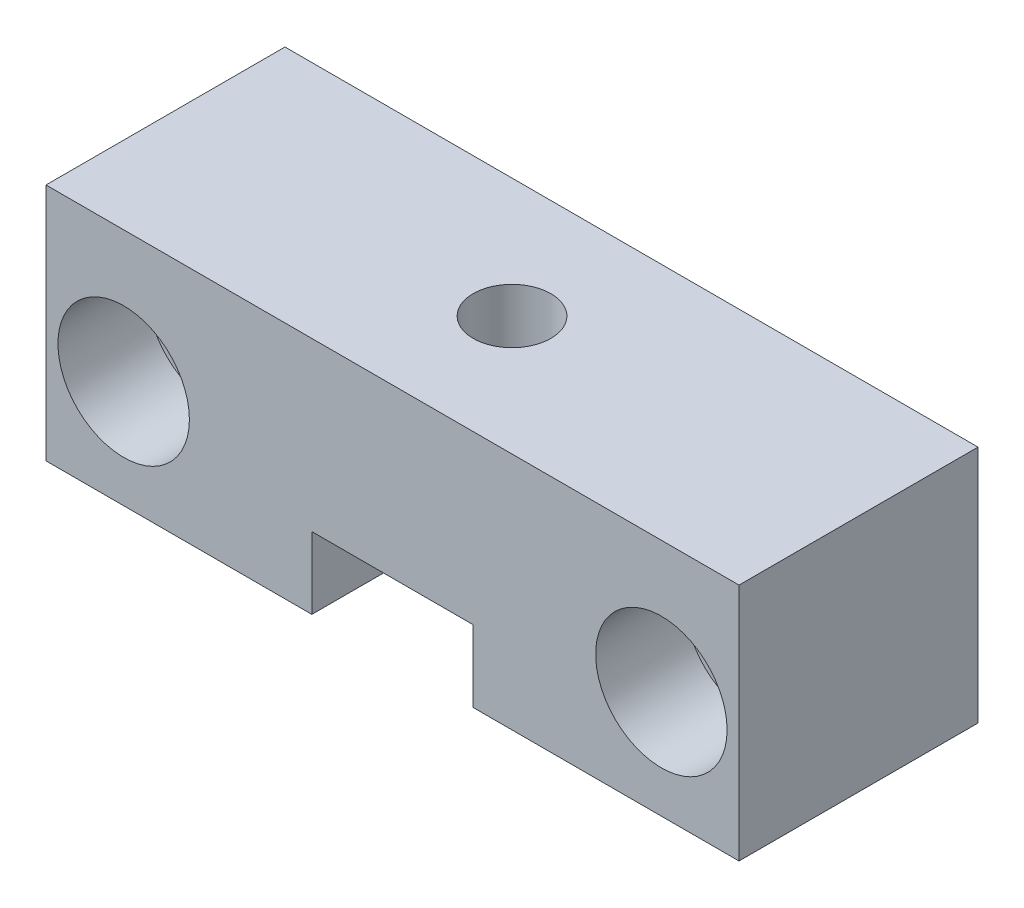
ISO-10303-21;
HEADER;
FILE_DESCRIPTION(('STEP AP214'),'2;1');
FILE_NAME('part.step','',(''),(''),'','','');
FILE_SCHEMA(('AUTOMOTIVE_DESIGN { 1 0 10303 214 1 1 1 1 }'));
ENDSEC;
DATA;
#1=APPLICATION_CONTEXT('core data for automotive mechanical design processes');
#2=APPLICATION_PROTOCOL_DEFINITION('international standard','automotive_design',2000,#1);
#3=PRODUCT_CONTEXT('',#1,'mechanical');
#4=PRODUCT('Part','Part','',(#3));
#5=PRODUCT_RELATED_PRODUCT_CATEGORY('part','',(#4));
#6=PRODUCT_DEFINITION_FORMATION('','',#4);
#7=PRODUCT_DEFINITION_CONTEXT('part definition',#1,'design');
#8=PRODUCT_DEFINITION('design','',#6,#7);
#9=PRODUCT_DEFINITION_SHAPE('','',#8);
#10=(LENGTH_UNIT() NAMED_UNIT(*) SI_UNIT(.MILLI.,.METRE.));
#11=(NAMED_UNIT(*) PLANE_ANGLE_UNIT() SI_UNIT($,.RADIAN.));
#12=(NAMED_UNIT(*) SI_UNIT($,.STERADIAN.) SOLID_ANGLE_UNIT());
#13=UNCERTAINTY_MEASURE_WITH_UNIT(LENGTH_MEASURE(1.E-05),#10,'distance_accuracy_value','');
#14=(GEOMETRIC_REPRESENTATION_CONTEXT(3) GLOBAL_UNCERTAINTY_ASSIGNED_CONTEXT((#13)) GLOBAL_UNIT_ASSIGNED_CONTEXT((#10,
#11,#12)) REPRESENTATION_CONTEXT('',''));
#15=CARTESIAN_POINT('',(0.,0.,0.));
#16=DIRECTION('',(0.,0.,1.));
#17=DIRECTION('',(1.,0.,0.));
#18=AXIS2_PLACEMENT_3D('',#15,#16,#17);
#19=CARTESIAN_POINT('',(22.5,0.,-7.5));
#20=DIRECTION('',(0.,0.,1.));
#21=DIRECTION('',(1.,0.,0.));
#22=AXIS2_PLACEMENT_3D('',#19,#20,#21);
#23=PLANE('',#22);
#24=CARTESIAN_POINT('',(22.5,0.,-7.5));
#25=DIRECTION('',(0.,0.,1.));
#26=DIRECTION('',(1.,0.,0.));
#27=AXIS2_PLACEMENT_3D('',#24,#25,#26);
#28=CIRCLE('',#27,3.);
#29=CARTESIAN_POINT('',(25.5,0.,-7.5));
#30=VERTEX_POINT('',#29);
#31=EDGE_CURVE('E18',#30,#30,#28,.F.);
#32=ORIENTED_EDGE('',*,*,#31,.T.);
#33=EDGE_LOOP('',(#32));
#34=FACE_BOUND('',#33,.T.);
#35=CARTESIAN_POINT('',(22.5,0.,-7.5));
#36=DIRECTION('',(0.,0.,1.));
#37=DIRECTION('',(1.,0.,0.));
#38=AXIS2_PLACEMENT_3D('',#35,#36,#37);
#39=CIRCLE('',#38,5.5);
#40=CARTESIAN_POINT('',(28.,0.,-7.5));
#41=VERTEX_POINT('',#40);
#42=EDGE_CURVE('E118',#41,#41,#39,.T.);
#43=ORIENTED_EDGE('',*,*,#42,.T.);
#44=EDGE_LOOP('',(#43));
#45=FACE_BOUND('',#44,.T.);
#46=ADVANCED_FACE('F15',(#34,#45),#23,.T.);
#47=CARTESIAN_POINT('',(-22.5,0.,-7.5));
#48=DIRECTION('',(0.,0.,1.));
#49=DIRECTION('',(1.,0.,0.));
#50=AXIS2_PLACEMENT_3D('',#47,#48,#49);
#51=PLANE('',#50);
#52=CARTESIAN_POINT('',(-22.5,0.,-7.5));
#53=DIRECTION('',(0.,0.,1.));
#54=DIRECTION('',(1.,0.,0.));
#55=AXIS2_PLACEMENT_3D('',#52,#53,#54);
#56=CIRCLE('',#55,3.);
#57=CARTESIAN_POINT('',(-19.5,0.,-7.5));
#58=VERTEX_POINT('',#57);
#59=EDGE_CURVE('E147',#58,#58,#56,.F.);
#60=ORIENTED_EDGE('',*,*,#59,.T.);
#61=EDGE_LOOP('',(#60));
#62=FACE_BOUND('',#61,.T.);
#63=CARTESIAN_POINT('',(-22.5,0.,-7.5));
#64=DIRECTION('',(0.,0.,1.));
#65=DIRECTION('',(1.,0.,0.));
#66=AXIS2_PLACEMENT_3D('',#63,#64,#65);
#67=CIRCLE('',#66,5.5);
#68=CARTESIAN_POINT('',(-17.,0.,-7.5));
#69=VERTEX_POINT('',#68);
#70=EDGE_CURVE('E93',#69,#69,#67,.T.);
#71=ORIENTED_EDGE('',*,*,#70,.T.);
#72=EDGE_LOOP('',(#71));
#73=FACE_BOUND('',#72,.T.);
#74=ADVANCED_FACE('F263',(#62,#73),#51,.T.);
#75=CARTESIAN_POINT('',(0.,-1.00000000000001,-10.));
#76=DIRECTION('',(0.,-1.,0.));
#77=DIRECTION('',(1.,0.,0.));
#78=AXIS2_PLACEMENT_3D('',#75,#76,#77);
#79=CYLINDRICAL_SURFACE('',#78,4.25);
#80=CARTESIAN_POINT('',(0.,0.99999999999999,-10.));
#81=DIRECTION('',(0.,-1.,0.));
#82=DIRECTION('',(1.,0.,0.));
#83=AXIS2_PLACEMENT_3D('',#80,#81,#82);
#84=CIRCLE('',#83,4.25);
#85=CARTESIAN_POINT('',(4.25,0.99999999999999,-10.));
#86=VERTEX_POINT('',#85);
#87=EDGE_CURVE('E92',#86,#86,#84,.T.);
#88=ORIENTED_EDGE('',*,*,#87,.F.);
#89=EDGE_LOOP('',(#88));
#90=FACE_BOUND('',#89,.T.);
#91=CARTESIAN_POINT('',(0.,-3.00000000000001,-10.));
#92=DIRECTION('',(0.,-1.,0.));
#93=DIRECTION('',(1.,0.,0.));
#94=AXIS2_PLACEMENT_3D('',#91,#92,#93);
#95=CIRCLE('',#94,4.25);
#96=CARTESIAN_POINT('',(4.25,-3.00000000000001,-10.));
#97=VERTEX_POINT('',#96);
#98=EDGE_CURVE('E122',#97,#97,#95,.F.);
#99=ORIENTED_EDGE('',*,*,#98,.F.);
#100=EDGE_LOOP('',(#99));
#101=FACE_BOUND('',#100,.T.);
#102=ADVANCED_FACE('F160',(#90,#101),#79,.F.);
#103=CARTESIAN_POINT('',(22.5,0.,-64.5290632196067));
#104=DIRECTION('',(0.,0.,1.));
#105=DIRECTION('',(1.,0.,0.));
#106=AXIS2_PLACEMENT_3D('',#103,#104,#105);
#107=CYLINDRICAL_SURFACE('',#106,3.);
#108=ORIENTED_EDGE('',*,*,#31,.F.);
#109=EDGE_LOOP('',(#108));
#110=FACE_BOUND('',#109,.T.);
#111=CARTESIAN_POINT('',(22.5,0.,-20.));
#112=DIRECTION('',(0.,0.,1.));
#113=DIRECTION('',(1.,0.,0.));
#114=AXIS2_PLACEMENT_3D('',#111,#112,#113);
#115=CIRCLE('',#114,3.);
#116=CARTESIAN_POINT('',(25.5,0.,-20.));
#117=VERTEX_POINT('',#116);
#118=EDGE_CURVE('E102',#117,#117,#115,.F.);
#119=ORIENTED_EDGE('',*,*,#118,.T.);
#120=EDGE_LOOP('',(#119));
#121=FACE_BOUND('',#120,.T.);
#122=ADVANCED_FACE('F156',(#110,#121),#107,.F.);
#123=CARTESIAN_POINT('',(-22.5,0.,-64.5290632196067));
#124=DIRECTION('',(0.,0.,1.));
#125=DIRECTION('',(1.,0.,0.));
#126=AXIS2_PLACEMENT_3D('',#123,#124,#125);
#127=CYLINDRICAL_SURFACE('',#126,3.);
#128=ORIENTED_EDGE('',*,*,#59,.F.);
#129=EDGE_LOOP('',(#128));
#130=FACE_BOUND('',#129,.T.);
#131=CARTESIAN_POINT('',(-22.5,0.,-20.));
#132=DIRECTION('',(0.,0.,1.));
#133=DIRECTION('',(1.,0.,0.));
#134=AXIS2_PLACEMENT_3D('',#131,#132,#133);
#135=CIRCLE('',#134,3.);
#136=CARTESIAN_POINT('',(-19.5,0.,-20.));
#137=VERTEX_POINT('',#136);
#138=EDGE_CURVE('E136',#137,#137,#135,.F.);
#139=ORIENTED_EDGE('',*,*,#138,.T.);
#140=EDGE_LOOP('',(#139));
#141=FACE_BOUND('',#140,.T.);
#142=ADVANCED_FACE('F159',(#130,#141),#127,.F.);
#143=CARTESIAN_POINT('',(-6.75,-3.00000000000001,0.));
#144=DIRECTION('',(0.,-1.,0.));
#145=DIRECTION('',(0.,0.,-1.));
#146=AXIS2_PLACEMENT_3D('',#143,#144,#145);
#147=PLANE('',#146);
#148=ORIENTED_EDGE('',*,*,#98,.T.);
#149=EDGE_LOOP('',(#148));
#150=FACE_BOUND('',#149,.T.);
#151=DIRECTION('',(1.,0.,0.));
#152=VECTOR('',#151,1.);
#153=CARTESIAN_POINT('',(0.,-3.00000000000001,0.));
#154=LINE('',#153,#152);
#155=CARTESIAN_POINT('',(-6.75,-3.00000000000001,0.));
#156=VERTEX_POINT('',#155);
#157=CARTESIAN_POINT('',(6.75,-3.00000000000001,0.));
#158=VERTEX_POINT('',#157);
#159=EDGE_CURVE('E219',#156,#158,#154,.T.);
#160=ORIENTED_EDGE('',*,*,#159,.F.);
#161=DIRECTION('',(0.,0.,-1.));
#162=VECTOR('',#161,1.);
#163=CARTESIAN_POINT('',(-6.75,-3.00000000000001,0.));
#164=LINE('',#163,#162);
#165=CARTESIAN_POINT('',(-6.75,-3.00000000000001,-20.));
#166=VERTEX_POINT('',#165);
#167=EDGE_CURVE('E119',#166,#156,#164,.F.);
#168=ORIENTED_EDGE('',*,*,#167,.F.);
#169=DIRECTION('',(1.,0.,0.));
#170=VECTOR('',#169,1.);
#171=CARTESIAN_POINT('',(0.,-3.00000000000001,-20.));
#172=LINE('',#171,#170);
#173=CARTESIAN_POINT('',(6.75,-3.00000000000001,-20.));
#174=VERTEX_POINT('',#173);
#175=EDGE_CURVE('E103',#166,#174,#172,.T.);
#176=ORIENTED_EDGE('',*,*,#175,.T.);
#177=DIRECTION('',(0.,0.,1.));
#178=VECTOR('',#177,1.);
#179=CARTESIAN_POINT('',(6.75,-3.00000000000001,0.));
#180=LINE('',#179,#178);
#181=EDGE_CURVE('E99',#158,#174,#180,.F.);
#182=ORIENTED_EDGE('',*,*,#181,.F.);
#183=EDGE_LOOP('',(#160,#168,#176,#182));
#184=FACE_BOUND('',#183,.T.);
#185=ADVANCED_FACE('F230',(#150,#184),#147,.T.);
#186=CARTESIAN_POINT('',(6.75,-3.00000000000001,0.));
#187=DIRECTION('',(-1.,0.,0.));
#188=DIRECTION('',(0.,0.,1.));
#189=AXIS2_PLACEMENT_3D('',#186,#187,#188);
#190=PLANE('',#189);
#191=DIRECTION('',(0.,1.,0.));
#192=VECTOR('',#191,1.);
#193=CARTESIAN_POINT('',(6.75,0.982142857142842,0.));
#194=LINE('',#193,#192);
#195=CARTESIAN_POINT('',(6.75,-9.00000000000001,0.));
#196=VERTEX_POINT('',#195);
#197=EDGE_CURVE('E217',#158,#196,#194,.F.);
#198=ORIENTED_EDGE('',*,*,#197,.F.);
#199=ORIENTED_EDGE('',*,*,#181,.T.);
#200=DIRECTION('',(0.,1.,0.));
#201=VECTOR('',#200,1.);
#202=CARTESIAN_POINT('',(6.75,0.982142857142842,-20.));
#203=LINE('',#202,#201);
#204=CARTESIAN_POINT('',(6.75,-9.00000000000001,-20.));
#205=VERTEX_POINT('',#204);
#206=EDGE_CURVE('E97',#174,#205,#203,.F.);
#207=ORIENTED_EDGE('',*,*,#206,.T.);
#208=DIRECTION('',(0.,0.,-1.));
#209=VECTOR('',#208,1.);
#210=CARTESIAN_POINT('',(6.75,-9.00000000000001,0.));
#211=LINE('',#210,#209);
#212=EDGE_CURVE('E81',#196,#205,#211,.T.);
#213=ORIENTED_EDGE('',*,*,#212,.F.);
#214=EDGE_LOOP('',(#198,#199,#207,#213));
#215=FACE_BOUND('',#214,.T.);
#216=ADVANCED_FACE('F98',(#215),#190,.T.);
#217=CARTESIAN_POINT('',(-29.,-9.00000000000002,0.));
#218=DIRECTION('',(0.,-1.,0.));
#219=DIRECTION('',(0.,0.,-1.));
#220=AXIS2_PLACEMENT_3D('',#217,#218,#219);
#221=PLANE('',#220);
#222=DIRECTION('',(1.,0.,0.));
#223=VECTOR('',#222,1.);
#224=CARTESIAN_POINT('',(0.,-9.00000000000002,0.));
#225=LINE('',#224,#223);
#226=CARTESIAN_POINT('',(-29.,-9.00000000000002,0.));
#227=VERTEX_POINT('',#226);
#228=CARTESIAN_POINT('',(-6.75,-9.00000000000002,0.));
#229=VERTEX_POINT('',#228);
#230=EDGE_CURVE('E207',#227,#229,#225,.T.);
#231=ORIENTED_EDGE('',*,*,#230,.F.);
#232=DIRECTION('',(0.,0.,1.));
#233=VECTOR('',#232,1.);
#234=CARTESIAN_POINT('',(-29.,-9.00000000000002,0.));
#235=LINE('',#234,#233);
#236=CARTESIAN_POINT('',(-29.,-9.00000000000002,-20.));
#237=VERTEX_POINT('',#236);
#238=EDGE_CURVE('E221',#237,#227,#235,.T.);
#239=ORIENTED_EDGE('',*,*,#238,.F.);
#240=DIRECTION('',(1.,0.,0.));
#241=VECTOR('',#240,1.);
#242=CARTESIAN_POINT('',(0.,-9.00000000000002,-20.));
#243=LINE('',#242,#241);
#244=CARTESIAN_POINT('',(-6.75,-9.00000000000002,-20.));
#245=VERTEX_POINT('',#244);
#246=EDGE_CURVE('E76',#237,#245,#243,.T.);
#247=ORIENTED_EDGE('',*,*,#246,.T.);
#248=DIRECTION('',(0.,0.,-1.));
#249=VECTOR('',#248,1.);
#250=CARTESIAN_POINT('',(-6.75,-9.00000000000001,0.));
#251=LINE('',#250,#249);
#252=EDGE_CURVE('E116',#229,#245,#251,.T.);
#253=ORIENTED_EDGE('',*,*,#252,.F.);
#254=EDGE_LOOP('',(#231,#239,#247,#253));
#255=FACE_BOUND('',#254,.T.);
#256=ADVANCED_FACE('F244',(#255),#221,.T.);
#257=CARTESIAN_POINT('',(-6.75,-9.00000000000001,0.));
#258=DIRECTION('',(1.,0.,0.));
#259=DIRECTION('',(0.,0.,-1.));
#260=AXIS2_PLACEMENT_3D('',#257,#258,#259);
#261=PLANE('',#260);
#262=DIRECTION('',(0.,1.,0.));
#263=VECTOR('',#262,1.);
#264=CARTESIAN_POINT('',(-6.75,0.982142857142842,0.));
#265=LINE('',#264,#263);
#266=EDGE_CURVE('E135',#229,#156,#265,.T.);
#267=ORIENTED_EDGE('',*,*,#266,.F.);
#268=ORIENTED_EDGE('',*,*,#252,.T.);
#269=DIRECTION('',(0.,1.,0.));
#270=VECTOR('',#269,1.);
#271=CARTESIAN_POINT('',(-6.75,0.982142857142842,-20.));
#272=LINE('',#271,#270);
#273=EDGE_CURVE('E110',#245,#166,#272,.T.);
#274=ORIENTED_EDGE('',*,*,#273,.T.);
#275=ORIENTED_EDGE('',*,*,#167,.T.);
#276=EDGE_LOOP('',(#267,#268,#274,#275));
#277=FACE_BOUND('',#276,.T.);
#278=ADVANCED_FACE('F228',(#277),#261,.T.);
#279=CARTESIAN_POINT('',(22.5,0.,-3.75));
#280=DIRECTION('',(0.,0.,1.));
#281=DIRECTION('',(1.,0.,0.));
#282=AXIS2_PLACEMENT_3D('',#279,#280,#281);
#283=CYLINDRICAL_SURFACE('',#282,5.5);
#284=ORIENTED_EDGE('',*,*,#42,.F.);
#285=EDGE_LOOP('',(#284));
#286=FACE_BOUND('',#285,.T.);
#287=CARTESIAN_POINT('',(22.5,0.,0.));
#288=DIRECTION('',(0.,0.,1.));
#289=DIRECTION('',(1.,0.,0.));
#290=AXIS2_PLACEMENT_3D('',#287,#288,#289);
#291=CIRCLE('',#290,5.5);
#292=CARTESIAN_POINT('',(28.,0.,0.));
#293=VERTEX_POINT('',#292);
#294=EDGE_CURVE('E132',#293,#293,#291,.F.);
#295=ORIENTED_EDGE('',*,*,#294,.F.);
#296=EDGE_LOOP('',(#295));
#297=FACE_BOUND('',#296,.T.);
#298=ADVANCED_FACE('F251',(#286,#297),#283,.F.);
#299=CARTESIAN_POINT('',(-22.5,0.,-3.75));
#300=DIRECTION('',(0.,0.,1.));
#301=DIRECTION('',(1.,0.,0.));
#302=AXIS2_PLACEMENT_3D('',#299,#300,#301);
#303=CYLINDRICAL_SURFACE('',#302,5.5);
#304=ORIENTED_EDGE('',*,*,#70,.F.);
#305=EDGE_LOOP('',(#304));
#306=FACE_BOUND('',#305,.T.);
#307=CARTESIAN_POINT('',(-22.5,0.,0.));
#308=DIRECTION('',(0.,0.,1.));
#309=DIRECTION('',(1.,0.,0.));
#310=AXIS2_PLACEMENT_3D('',#307,#308,#309);
#311=CIRCLE('',#310,5.5);
#312=CARTESIAN_POINT('',(-17.,0.,0.));
#313=VERTEX_POINT('',#312);
#314=EDGE_CURVE('E129',#313,#313,#311,.F.);
#315=ORIENTED_EDGE('',*,*,#314,.F.);
#316=EDGE_LOOP('',(#315));
#317=FACE_BOUND('',#316,.T.);
#318=ADVANCED_FACE('F272',(#306,#317),#303,.F.);
#319=CARTESIAN_POINT('',(6.75,-9.00000000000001,0.));
#320=DIRECTION('',(0.,-1.,0.));
#321=DIRECTION('',(0.,0.,-1.));
#322=AXIS2_PLACEMENT_3D('',#319,#320,#321);
#323=PLANE('',#322);
#324=DIRECTION('',(1.,0.,0.));
#325=VECTOR('',#324,1.);
#326=CARTESIAN_POINT('',(0.,-9.00000000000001,0.));
#327=LINE('',#326,#325);
#328=CARTESIAN_POINT('',(29.,-9.00000000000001,0.));
#329=VERTEX_POINT('',#328);
#330=EDGE_CURVE('E88',#196,#329,#327,.T.);
#331=ORIENTED_EDGE('',*,*,#330,.F.);
#332=ORIENTED_EDGE('',*,*,#212,.T.);
#333=DIRECTION('',(1.,0.,0.));
#334=VECTOR('',#333,1.);
#335=CARTESIAN_POINT('',(0.,-9.00000000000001,-20.));
#336=LINE('',#335,#334);
#337=CARTESIAN_POINT('',(29.,-9.00000000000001,-20.));
#338=VERTEX_POINT('',#337);
#339=EDGE_CURVE('E86',#205,#338,#336,.T.);
#340=ORIENTED_EDGE('',*,*,#339,.T.);
#341=DIRECTION('',(0.,0.,-1.));
#342=VECTOR('',#341,1.);
#343=CARTESIAN_POINT('',(29.,-9.00000000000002,0.));
#344=LINE('',#343,#342);
#345=EDGE_CURVE('E128',#329,#338,#344,.T.);
#346=ORIENTED_EDGE('',*,*,#345,.F.);
#347=EDGE_LOOP('',(#331,#332,#340,#346));
#348=FACE_BOUND('',#347,.T.);
#349=ADVANCED_FACE('F83',(#348),#323,.T.);
#350=CARTESIAN_POINT('',(0.,0.99999999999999,-10.));
#351=DIRECTION('',(0.,-1.,0.));
#352=DIRECTION('',(0.,0.,-1.));
#353=AXIS2_PLACEMENT_3D('',#350,#351,#352);
#354=PLANE('',#353);
#355=CARTESIAN_POINT('',(0.,0.999999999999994,-10.));
#356=DIRECTION('',(0.,-1.,0.));
#357=DIRECTION('',(1.,0.,0.));
#358=AXIS2_PLACEMENT_3D('',#355,#356,#357);
#359=CIRCLE('',#358,3.25);
#360=CARTESIAN_POINT('',(3.25,0.999999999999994,-10.));
#361=VERTEX_POINT('',#360);
#362=EDGE_CURVE('E124',#361,#361,#359,.F.);
#363=ORIENTED_EDGE('',*,*,#362,.T.);
#364=EDGE_LOOP('',(#363));
#365=FACE_BOUND('',#364,.T.);
#366=ORIENTED_EDGE('',*,*,#87,.T.);
#367=EDGE_LOOP('',(#366));
#368=FACE_BOUND('',#367,.T.);
#369=ADVANCED_FACE('F166',(#365,#368),#354,.T.);
#370=CARTESIAN_POINT('',(0.,0.982142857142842,-20.));
#371=DIRECTION('',(0.,0.,1.));
#372=DIRECTION('',(1.,0.,0.));
#373=AXIS2_PLACEMENT_3D('',#370,#371,#372);
#374=PLANE('',#373);
#375=ORIENTED_EDGE('',*,*,#138,.F.);
#376=EDGE_LOOP('',(#375));
#377=FACE_BOUND('',#376,.T.);
#378=ORIENTED_EDGE('',*,*,#118,.F.);
#379=EDGE_LOOP('',(#378));
#380=FACE_BOUND('',#379,.T.);
#381=ORIENTED_EDGE('',*,*,#175,.F.);
#382=ORIENTED_EDGE('',*,*,#273,.F.);
#383=ORIENTED_EDGE('',*,*,#246,.F.);
#384=DIRECTION('',(0.,1.,0.));
#385=VECTOR('',#384,1.);
#386=CARTESIAN_POINT('',(-29.,11.,-20.));
#387=LINE('',#386,#385);
#388=CARTESIAN_POINT('',(-29.,11.,-20.));
#389=VERTEX_POINT('',#388);
#390=EDGE_CURVE('E139',#389,#237,#387,.F.);
#391=ORIENTED_EDGE('',*,*,#390,.F.);
#392=DIRECTION('',(1.,0.,0.));
#393=VECTOR('',#392,1.);
#394=CARTESIAN_POINT('',(29.,11.,-20.));
#395=LINE('',#394,#393);
#396=CARTESIAN_POINT('',(29.,11.,-20.));
#397=VERTEX_POINT('',#396);
#398=EDGE_CURVE('E127',#397,#389,#395,.F.);
#399=ORIENTED_EDGE('',*,*,#398,.F.);
#400=DIRECTION('',(0.,1.,0.));
#401=VECTOR('',#400,1.);
#402=CARTESIAN_POINT('',(29.,-9.00000000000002,-20.));
#403=LINE('',#402,#401);
#404=EDGE_CURVE('E107',#338,#397,#403,.T.);
#405=ORIENTED_EDGE('',*,*,#404,.F.);
#406=ORIENTED_EDGE('',*,*,#339,.F.);
#407=ORIENTED_EDGE('',*,*,#206,.F.);
#408=EDGE_LOOP('',(#381,#382,#383,#391,#399,#405,#406,#407));
#409=FACE_BOUND('',#408,.T.);
#410=ADVANCED_FACE('F105',(#377,#380,#409),#374,.F.);
#411=CARTESIAN_POINT('',(-29.,11.,0.));
#412=DIRECTION('',(-1.,0.,0.));
#413=DIRECTION('',(0.,0.,1.));
#414=AXIS2_PLACEMENT_3D('',#411,#412,#413);
#415=PLANE('',#414);
#416=DIRECTION('',(0.,1.,0.));
#417=VECTOR('',#416,1.);
#418=CARTESIAN_POINT('',(-29.,0.982142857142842,0.));
#419=LINE('',#418,#417);
#420=CARTESIAN_POINT('',(-29.,11.,0.));
#421=VERTEX_POINT('',#420);
#422=EDGE_CURVE('E210',#421,#227,#419,.F.);
#423=ORIENTED_EDGE('',*,*,#422,.F.);
#424=DIRECTION('',(0.,0.,1.));
#425=VECTOR('',#424,1.);
#426=CARTESIAN_POINT('',(-29.,11.,0.));
#427=LINE('',#426,#425);
#428=EDGE_CURVE('E238',#389,#421,#427,.T.);
#429=ORIENTED_EDGE('',*,*,#428,.F.);
#430=ORIENTED_EDGE('',*,*,#390,.T.);
#431=ORIENTED_EDGE('',*,*,#238,.T.);
#432=EDGE_LOOP('',(#423,#429,#430,#431));
#433=FACE_BOUND('',#432,.T.);
#434=ADVANCED_FACE('F165',(#433),#415,.T.);
#435=CARTESIAN_POINT('',(0.,0.982142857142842,0.));
#436=DIRECTION('',(0.,0.,1.));
#437=DIRECTION('',(1.,0.,0.));
#438=AXIS2_PLACEMENT_3D('',#435,#436,#437);
#439=PLANE('',#438);
#440=ORIENTED_EDGE('',*,*,#314,.T.);
#441=EDGE_LOOP('',(#440));
#442=FACE_BOUND('',#441,.T.);
#443=ORIENTED_EDGE('',*,*,#294,.T.);
#444=EDGE_LOOP('',(#443));
#445=FACE_BOUND('',#444,.T.);
#446=ORIENTED_EDGE('',*,*,#230,.T.);
#447=ORIENTED_EDGE('',*,*,#266,.T.);
#448=ORIENTED_EDGE('',*,*,#159,.T.);
#449=ORIENTED_EDGE('',*,*,#197,.T.);
#450=ORIENTED_EDGE('',*,*,#330,.T.);
#451=DIRECTION('',(0.,1.,0.));
#452=VECTOR('',#451,1.);
#453=CARTESIAN_POINT('',(29.,-9.00000000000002,0.));
#454=LINE('',#453,#452);
#455=CARTESIAN_POINT('',(29.,11.,0.));
#456=VERTEX_POINT('',#455);
#457=EDGE_CURVE('E33',#456,#329,#454,.F.);
#458=ORIENTED_EDGE('',*,*,#457,.F.);
#459=DIRECTION('',(1.,0.,0.));
#460=VECTOR('',#459,1.);
#461=CARTESIAN_POINT('',(29.,11.,0.));
#462=LINE('',#461,#460);
#463=EDGE_CURVE('E241',#421,#456,#462,.T.);
#464=ORIENTED_EDGE('',*,*,#463,.F.);
#465=ORIENTED_EDGE('',*,*,#422,.T.);
#466=EDGE_LOOP('',(#446,#447,#448,#449,#450,#458,#464,#465));
#467=FACE_BOUND('',#466,.T.);
#468=ADVANCED_FACE('F174',(#442,#445,#467),#439,.T.);
#469=CARTESIAN_POINT('',(29.,-9.00000000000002,0.));
#470=DIRECTION('',(1.,0.,0.));
#471=DIRECTION('',(0.,0.,-1.));
#472=AXIS2_PLACEMENT_3D('',#469,#470,#471);
#473=PLANE('',#472);
#474=ORIENTED_EDGE('',*,*,#457,.T.);
#475=ORIENTED_EDGE('',*,*,#345,.T.);
#476=ORIENTED_EDGE('',*,*,#404,.T.);
#477=DIRECTION('',(0.,0.,1.));
#478=VECTOR('',#477,1.);
#479=CARTESIAN_POINT('',(29.,11.,0.));
#480=LINE('',#479,#478);
#481=EDGE_CURVE('E24',#456,#397,#480,.F.);
#482=ORIENTED_EDGE('',*,*,#481,.F.);
#483=EDGE_LOOP('',(#474,#475,#476,#482));
#484=FACE_BOUND('',#483,.T.);
#485=ADVANCED_FACE('F188',(#484),#473,.T.);
#486=CARTESIAN_POINT('',(0.,61.5290632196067,-10.));
#487=DIRECTION('',(0.,-1.,0.));
#488=DIRECTION('',(1.,0.,0.));
#489=AXIS2_PLACEMENT_3D('',#486,#487,#488);
#490=CYLINDRICAL_SURFACE('',#489,3.25);
#491=ORIENTED_EDGE('',*,*,#362,.F.);
#492=EDGE_LOOP('',(#491));
#493=FACE_BOUND('',#492,.T.);
#494=CARTESIAN_POINT('',(0.,11.,-10.));
#495=DIRECTION('',(0.,-1.,0.));
#496=DIRECTION('',(1.,0.,0.));
#497=AXIS2_PLACEMENT_3D('',#494,#495,#496);
#498=CIRCLE('',#497,3.25);
#499=CARTESIAN_POINT('',(3.25,11.,-10.));
#500=VERTEX_POINT('',#499);
#501=EDGE_CURVE('E9',#500,#500,#498,.T.);
#502=ORIENTED_EDGE('',*,*,#501,.F.);
#503=EDGE_LOOP('',(#502));
#504=FACE_BOUND('',#503,.T.);
#505=ADVANCED_FACE('F182',(#493,#504),#490,.F.);
#506=CARTESIAN_POINT('',(29.,11.,0.));
#507=DIRECTION('',(0.,1.,0.));
#508=DIRECTION('',(0.,0.,1.));
#509=AXIS2_PLACEMENT_3D('',#506,#507,#508);
#510=PLANE('',#509);
#511=ORIENTED_EDGE('',*,*,#501,.T.);
#512=EDGE_LOOP('',(#511));
#513=FACE_BOUND('',#512,.T.);
#514=ORIENTED_EDGE('',*,*,#463,.T.);
#515=ORIENTED_EDGE('',*,*,#481,.T.);
#516=ORIENTED_EDGE('',*,*,#398,.T.);
#517=ORIENTED_EDGE('',*,*,#428,.T.);
#518=EDGE_LOOP('',(#514,#515,#516,#517));
#519=FACE_BOUND('',#518,.T.);
#520=ADVANCED_FACE('F180',(#513,#519),#510,.T.);
#521=CLOSED_SHELL('',(#46,#74,#102,#122,#142,#185,#216,#256,#278,#298,#318,#349,#369,#410,#434,
#468,#485,#505,#520));
#522=MANIFOLD_SOLID_BREP('B1',#521);
#523=ADVANCED_BREP_SHAPE_REPRESENTATION('',(#18,#522),#14);
#524=SHAPE_DEFINITION_REPRESENTATION(#9,#523);
ENDSEC;
END-ISO-10303-21;
